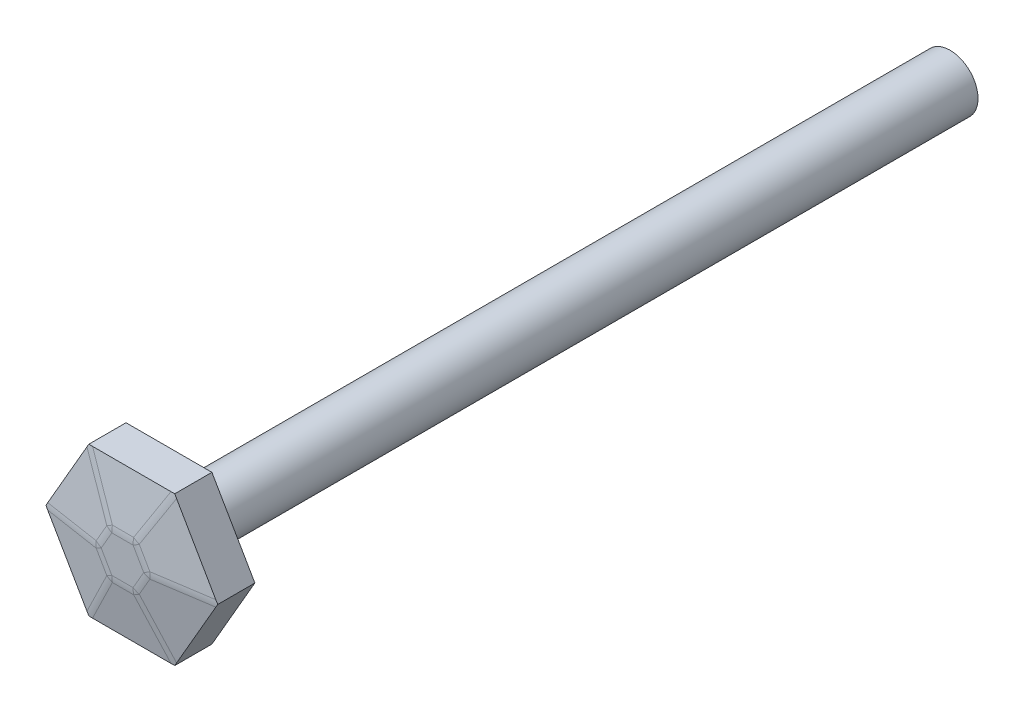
ISO-10303-21;
HEADER;
FILE_DESCRIPTION(('STEP AP214'),'2;1');
FILE_NAME('part.step','',(''),(''),'','','');
FILE_SCHEMA(('AUTOMOTIVE_DESIGN { 1 0 10303 214 1 1 1 1 }'));
ENDSEC;
DATA;
#1=APPLICATION_CONTEXT('core data for automotive mechanical design processes');
#2=APPLICATION_PROTOCOL_DEFINITION('international standard','automotive_design',2000,#1);
#3=PRODUCT_CONTEXT('',#1,'mechanical');
#4=PRODUCT('Part','Part','',(#3));
#5=PRODUCT_RELATED_PRODUCT_CATEGORY('part','',(#4));
#6=PRODUCT_DEFINITION_FORMATION('','',#4);
#7=PRODUCT_DEFINITION_CONTEXT('part definition',#1,'design');
#8=PRODUCT_DEFINITION('design','',#6,#7);
#9=PRODUCT_DEFINITION_SHAPE('','',#8);
#10=(LENGTH_UNIT() NAMED_UNIT(*) SI_UNIT(.MILLI.,.METRE.));
#11=(NAMED_UNIT(*) PLANE_ANGLE_UNIT() SI_UNIT($,.RADIAN.));
#12=(NAMED_UNIT(*) SI_UNIT($,.STERADIAN.) SOLID_ANGLE_UNIT());
#13=UNCERTAINTY_MEASURE_WITH_UNIT(LENGTH_MEASURE(1.E-05),#10,'distance_accuracy_value','');
#14=(GEOMETRIC_REPRESENTATION_CONTEXT(3) GLOBAL_UNCERTAINTY_ASSIGNED_CONTEXT((#13)) GLOBAL_UNIT_ASSIGNED_CONTEXT((#10,
#11,#12)) REPRESENTATION_CONTEXT('',''));
#15=CARTESIAN_POINT('',(0.,0.,0.));
#16=DIRECTION('',(0.,0.,1.));
#17=DIRECTION('',(1.,0.,0.));
#18=AXIS2_PLACEMENT_3D('',#15,#16,#17);
#19=CARTESIAN_POINT('',(0.,0.,53.34));
#20=DIRECTION('',(0.,0.,-1.));
#21=DIRECTION('',(-1.,0.,0.));
#22=AXIS2_PLACEMENT_3D('',#19,#20,#21);
#23=CYLINDRICAL_SURFACE('',#22,1.905);
#24=CARTESIAN_POINT('',(0.,0.,53.34));
#25=DIRECTION('',(0.,0.,1.));
#26=DIRECTION('',(1.,0.,0.));
#27=AXIS2_PLACEMENT_3D('',#24,#25,#26);
#28=CIRCLE('',#27,1.905);
#29=CARTESIAN_POINT('',(1.905,0.,53.34));
#30=VERTEX_POINT('',#29);
#31=EDGE_CURVE('E228',#30,#30,#28,.T.);
#32=ORIENTED_EDGE('',*,*,#31,.F.);
#33=EDGE_LOOP('',(#32));
#34=FACE_BOUND('',#33,.T.);
#35=CARTESIAN_POINT('',(0.,0.,0.));
#36=DIRECTION('',(0.,0.,1.));
#37=DIRECTION('',(1.,0.,0.));
#38=AXIS2_PLACEMENT_3D('',#35,#36,#37);
#39=CIRCLE('',#38,1.905);
#40=CARTESIAN_POINT('',(1.905,0.,0.));
#41=VERTEX_POINT('',#40);
#42=EDGE_CURVE('E190',#41,#41,#39,.T.);
#43=ORIENTED_EDGE('',*,*,#42,.T.);
#44=EDGE_LOOP('',(#43));
#45=FACE_BOUND('',#44,.T.);
#46=ADVANCED_FACE('F32',(#34,#45),#23,.T.);
#47=CARTESIAN_POINT('',(0.,0.,0.));
#48=DIRECTION('',(0.,0.,1.));
#49=DIRECTION('',(1.,0.,0.));
#50=AXIS2_PLACEMENT_3D('',#47,#48,#49);
#51=PLANE('',#50);
#52=ORIENTED_EDGE('',*,*,#42,.F.);
#53=EDGE_LOOP('',(#52));
#54=FACE_BOUND('',#53,.T.);
#55=ADVANCED_FACE('F466',(#54),#51,.F.);
#56=CARTESIAN_POINT('',(5.8658787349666,0.,53.34));
#57=DIRECTION('',(0.,0.,1.));
#58=DIRECTION('',(1.,0.,0.));
#59=AXIS2_PLACEMENT_3D('',#56,#57,#58);
#60=PLANE('',#59);
#61=DIRECTION('',(0.5,0.866025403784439,0.));
#62=VECTOR('',#61,1.);
#63=CARTESIAN_POINT('',(2.9329393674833,-5.08,53.34));
#64=LINE('',#63,#62);
#65=CARTESIAN_POINT('',(2.9329393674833,-5.08,53.34));
#66=VERTEX_POINT('',#65);
#67=CARTESIAN_POINT('',(5.8658787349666,0.,53.34));
#68=VERTEX_POINT('',#67);
#69=EDGE_CURVE('E198',#66,#68,#64,.T.);
#70=ORIENTED_EDGE('',*,*,#69,.F.);
#71=DIRECTION('',(1.,0.,0.));
#72=VECTOR('',#71,1.);
#73=CARTESIAN_POINT('',(-2.9329393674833,-5.08,53.34));
#74=LINE('',#73,#72);
#75=CARTESIAN_POINT('',(-2.9329393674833,-5.08,53.34));
#76=VERTEX_POINT('',#75);
#77=EDGE_CURVE('E218',#76,#66,#74,.T.);
#78=ORIENTED_EDGE('',*,*,#77,.F.);
#79=DIRECTION('',(0.5,-0.866025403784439,0.));
#80=VECTOR('',#79,1.);
#81=CARTESIAN_POINT('',(-5.8658787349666,0.,53.34));
#82=LINE('',#81,#80);
#83=CARTESIAN_POINT('',(-5.8658787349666,0.,53.34));
#84=VERTEX_POINT('',#83);
#85=EDGE_CURVE('E215',#84,#76,#82,.T.);
#86=ORIENTED_EDGE('',*,*,#85,.F.);
#87=DIRECTION('',(-0.5,-0.866025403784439,0.));
#88=VECTOR('',#87,1.);
#89=CARTESIAN_POINT('',(-2.9329393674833,5.08,53.34));
#90=LINE('',#89,#88);
#91=CARTESIAN_POINT('',(-2.9329393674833,5.08,53.34));
#92=VERTEX_POINT('',#91);
#93=EDGE_CURVE('E212',#92,#84,#90,.T.);
#94=ORIENTED_EDGE('',*,*,#93,.F.);
#95=DIRECTION('',(-1.,0.,0.));
#96=VECTOR('',#95,1.);
#97=CARTESIAN_POINT('',(2.9329393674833,5.08,53.34));
#98=LINE('',#97,#96);
#99=CARTESIAN_POINT('',(2.9329393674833,5.08,53.34));
#100=VERTEX_POINT('',#99);
#101=EDGE_CURVE('E201',#100,#92,#98,.T.);
#102=ORIENTED_EDGE('',*,*,#101,.F.);
#103=DIRECTION('',(-0.5,0.866025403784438,0.));
#104=VECTOR('',#103,1.);
#105=CARTESIAN_POINT('',(5.8658787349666,0.,53.34));
#106=LINE('',#105,#104);
#107=EDGE_CURVE('E182',#68,#100,#106,.T.);
#108=ORIENTED_EDGE('',*,*,#107,.F.);
#109=EDGE_LOOP('',(#70,#78,#86,#94,#102,#108));
#110=FACE_BOUND('',#109,.T.);
#111=ORIENTED_EDGE('',*,*,#31,.T.);
#112=EDGE_LOOP('',(#111));
#113=FACE_BOUND('',#112,.T.);
#114=ADVANCED_FACE('F195',(#110,#113),#60,.F.);
#115=CARTESIAN_POINT('',(2.9329393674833,-5.08,56.515));
#116=DIRECTION('',(-0.866025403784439,0.5,0.));
#117=DIRECTION('',(-0.5,-0.866025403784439,0.));
#118=AXIS2_PLACEMENT_3D('',#115,#116,#117);
#119=PLANE('',#118);
#120=DIRECTION('',(0.,0.,-1.));
#121=VECTOR('',#120,1.);
#122=CARTESIAN_POINT('',(5.8658787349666,0.,56.515));
#123=LINE('',#122,#121);
#124=CARTESIAN_POINT('',(5.8658787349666,0.,55.8702601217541));
#125=VERTEX_POINT('',#124);
#126=EDGE_CURVE('E178',#125,#68,#123,.T.);
#127=ORIENTED_EDGE('',*,*,#126,.F.);
#128=CARTESIAN_POINT('',(5.8658787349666,0.,53.3008164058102));
#129=DIRECTION('',(-0.866025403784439,0.5,0.));
#130=DIRECTION('',(-0.478195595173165,-0.828259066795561,0.292088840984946));
#131=AXIS2_PLACEMENT_3D('',#128,#129,#130);
#132=ELLIPSE('',#131,2.96693804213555,2.54);
#133=CARTESIAN_POINT('',(5.73855384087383,-0.220533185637,55.88));
#134=VERTEX_POINT('',#133);
#135=EDGE_CURVE('E307',#125,#134,#132,.F.);
#136=ORIENTED_EDGE('',*,*,#135,.T.);
#137=DIRECTION('',(-0.5,-0.866025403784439,0.));
#138=VECTOR('',#137,1.);
#139=CARTESIAN_POINT('',(2.9329393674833,-5.08,55.88));
#140=LINE('',#139,#138);
#141=CARTESIAN_POINT('',(3.06026426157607,-4.859466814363,55.88));
#142=VERTEX_POINT('',#141);
#143=EDGE_CURVE('E231',#134,#142,#140,.T.);
#144=ORIENTED_EDGE('',*,*,#143,.T.);
#145=CARTESIAN_POINT('',(2.9329393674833,-5.08,53.3008164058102));
#146=DIRECTION('',(-0.866025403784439,0.5,0.));
#147=DIRECTION('',(-0.478195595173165,-0.828259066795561,-0.292088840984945));
#148=AXIS2_PLACEMENT_3D('',#145,#146,#147);
#149=ELLIPSE('',#148,2.96693804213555,2.54);
#150=CARTESIAN_POINT('',(2.9329393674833,-5.08,55.8702601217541));
#151=VERTEX_POINT('',#150);
#152=EDGE_CURVE('E305',#142,#151,#149,.F.);
#153=ORIENTED_EDGE('',*,*,#152,.T.);
#154=DIRECTION('',(0.,0.,-1.));
#155=VECTOR('',#154,1.);
#156=CARTESIAN_POINT('',(2.9329393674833,-5.08,56.515));
#157=LINE('',#156,#155);
#158=EDGE_CURVE('E205',#151,#66,#157,.T.);
#159=ORIENTED_EDGE('',*,*,#158,.T.);
#160=ORIENTED_EDGE('',*,*,#69,.T.);
#161=EDGE_LOOP('',(#127,#136,#144,#153,#159,#160));
#162=FACE_BOUND('',#161,.T.);
#163=ADVANCED_FACE('F203',(#162),#119,.F.);
#164=CARTESIAN_POINT('',(5.8658787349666,0.,56.515));
#165=DIRECTION('',(-0.866025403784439,-0.5,0.));
#166=DIRECTION('',(0.5,-0.866025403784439,0.));
#167=AXIS2_PLACEMENT_3D('',#164,#165,#166);
#168=PLANE('',#167);
#169=DIRECTION('',(0.,0.,-1.));
#170=VECTOR('',#169,1.);
#171=CARTESIAN_POINT('',(2.9329393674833,5.08,56.515));
#172=LINE('',#171,#170);
#173=CARTESIAN_POINT('',(2.9329393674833,5.08,55.8702601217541));
#174=VERTEX_POINT('',#173);
#175=EDGE_CURVE('E191',#174,#100,#172,.T.);
#176=ORIENTED_EDGE('',*,*,#175,.F.);
#177=CARTESIAN_POINT('',(2.9329393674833,5.08,53.3008164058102));
#178=DIRECTION('',(-0.866025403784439,-0.5,0.));
#179=DIRECTION('',(0.478195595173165,-0.828259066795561,0.292088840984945));
#180=AXIS2_PLACEMENT_3D('',#177,#178,#179);
#181=ELLIPSE('',#180,2.96693804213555,2.54);
#182=CARTESIAN_POINT('',(3.06026426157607,4.859466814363,55.88));
#183=VERTEX_POINT('',#182);
#184=EDGE_CURVE('E303',#174,#183,#181,.F.);
#185=ORIENTED_EDGE('',*,*,#184,.T.);
#186=DIRECTION('',(0.5,-0.866025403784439,0.));
#187=VECTOR('',#186,1.);
#188=CARTESIAN_POINT('',(5.8658787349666,0.,55.88));
#189=LINE('',#188,#187);
#190=CARTESIAN_POINT('',(5.73855384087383,0.220533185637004,55.88));
#191=VERTEX_POINT('',#190);
#192=EDGE_CURVE('E246',#183,#191,#189,.T.);
#193=ORIENTED_EDGE('',*,*,#192,.T.);
#194=CARTESIAN_POINT('',(5.8658787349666,0.,53.3008164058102));
#195=DIRECTION('',(-0.866025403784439,-0.5,0.));
#196=DIRECTION('',(-0.478195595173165,0.828259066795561,0.292088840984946));
#197=AXIS2_PLACEMENT_3D('',#194,#195,#196);
#198=ELLIPSE('',#197,2.96693804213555,2.54);
#199=EDGE_CURVE('E186',#191,#125,#198,.F.);
#200=ORIENTED_EDGE('',*,*,#199,.T.);
#201=ORIENTED_EDGE('',*,*,#126,.T.);
#202=ORIENTED_EDGE('',*,*,#107,.T.);
#203=EDGE_LOOP('',(#176,#185,#193,#200,#201,#202));
#204=FACE_BOUND('',#203,.T.);
#205=ADVANCED_FACE('F181',(#204),#168,.F.);
#206=CARTESIAN_POINT('',(2.9329393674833,5.08,56.515));
#207=DIRECTION('',(0.,-1.,0.));
#208=DIRECTION('',(0.,0.,-1.));
#209=AXIS2_PLACEMENT_3D('',#206,#207,#208);
#210=PLANE('',#209);
#211=DIRECTION('',(1.,0.,0.));
#212=VECTOR('',#211,1.);
#213=CARTESIAN_POINT('',(2.9329393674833,5.08,55.88));
#214=LINE('',#213,#212);
#215=CARTESIAN_POINT('',(-2.67828957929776,5.08,55.88));
#216=VERTEX_POINT('',#215);
#217=CARTESIAN_POINT('',(2.67828957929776,5.08,55.88));
#218=VERTEX_POINT('',#217);
#219=EDGE_CURVE('E243',#216,#218,#214,.T.);
#220=ORIENTED_EDGE('',*,*,#219,.T.);
#221=CARTESIAN_POINT('',(2.9329393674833,5.08,53.3008164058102));
#222=DIRECTION('',(0.,-1.,0.));
#223=DIRECTION('',(-0.956391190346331,0.,0.292088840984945));
#224=AXIS2_PLACEMENT_3D('',#221,#222,#223);
#225=ELLIPSE('',#224,2.96693804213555,2.54);
#226=EDGE_CURVE('E300',#218,#174,#225,.F.);
#227=ORIENTED_EDGE('',*,*,#226,.T.);
#228=ORIENTED_EDGE('',*,*,#175,.T.);
#229=ORIENTED_EDGE('',*,*,#101,.T.);
#230=DIRECTION('',(0.,0.,-1.));
#231=VECTOR('',#230,1.);
#232=CARTESIAN_POINT('',(-2.9329393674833,5.08,56.515));
#233=LINE('',#232,#231);
#234=CARTESIAN_POINT('',(-2.9329393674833,5.08,55.8702601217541));
#235=VERTEX_POINT('',#234);
#236=EDGE_CURVE('E225',#235,#92,#233,.T.);
#237=ORIENTED_EDGE('',*,*,#236,.F.);
#238=CARTESIAN_POINT('',(-2.9329393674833,5.08,53.3008164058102));
#239=DIRECTION('',(0.,-1.,0.));
#240=DIRECTION('',(0.956391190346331,0.,0.292088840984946));
#241=AXIS2_PLACEMENT_3D('',#238,#239,#240);
#242=ELLIPSE('',#241,2.96693804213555,2.54);
#243=EDGE_CURVE('E298',#235,#216,#242,.F.);
#244=ORIENTED_EDGE('',*,*,#243,.T.);
#245=EDGE_LOOP('',(#220,#227,#228,#229,#237,#244));
#246=FACE_BOUND('',#245,.T.);
#247=ADVANCED_FACE('F386',(#246),#210,.F.);
#248=CARTESIAN_POINT('',(-2.9329393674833,5.08,56.515));
#249=DIRECTION('',(0.866025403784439,-0.5,0.));
#250=DIRECTION('',(0.5,0.866025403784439,0.));
#251=AXIS2_PLACEMENT_3D('',#248,#249,#250);
#252=PLANE('',#251);
#253=DIRECTION('',(0.,0.,-1.));
#254=VECTOR('',#253,1.);
#255=CARTESIAN_POINT('',(-5.8658787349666,0.,56.515));
#256=LINE('',#255,#254);
#257=CARTESIAN_POINT('',(-5.8658787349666,0.,55.8702601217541));
#258=VERTEX_POINT('',#257);
#259=EDGE_CURVE('E223',#258,#84,#256,.T.);
#260=ORIENTED_EDGE('',*,*,#259,.F.);
#261=CARTESIAN_POINT('',(-5.8658787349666,0.,53.3008164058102));
#262=DIRECTION('',(0.866025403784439,-0.5,0.));
#263=DIRECTION('',(-0.478195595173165,-0.828259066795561,-0.292088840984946));
#264=AXIS2_PLACEMENT_3D('',#261,#262,#263);
#265=ELLIPSE('',#264,2.96693804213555,2.54);
#266=CARTESIAN_POINT('',(-5.73855384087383,0.220533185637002,55.88));
#267=VERTEX_POINT('',#266);
#268=EDGE_CURVE('E11',#258,#267,#265,.F.);
#269=ORIENTED_EDGE('',*,*,#268,.T.);
#270=DIRECTION('',(0.5,0.866025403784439,0.));
#271=VECTOR('',#270,1.);
#272=CARTESIAN_POINT('',(-2.9329393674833,5.08,55.88));
#273=LINE('',#272,#271);
#274=CARTESIAN_POINT('',(-3.06026426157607,4.859466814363,55.88));
#275=VERTEX_POINT('',#274);
#276=EDGE_CURVE('E240',#267,#275,#273,.T.);
#277=ORIENTED_EDGE('',*,*,#276,.T.);
#278=CARTESIAN_POINT('',(-2.9329393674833,5.08,53.3008164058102));
#279=DIRECTION('',(0.866025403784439,-0.5,0.));
#280=DIRECTION('',(-0.478195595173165,-0.828259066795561,0.292088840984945));
#281=AXIS2_PLACEMENT_3D('',#278,#279,#280);
#282=ELLIPSE('',#281,2.96693804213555,2.54);
#283=EDGE_CURVE('E41',#275,#235,#282,.F.);
#284=ORIENTED_EDGE('',*,*,#283,.T.);
#285=ORIENTED_EDGE('',*,*,#236,.T.);
#286=ORIENTED_EDGE('',*,*,#93,.T.);
#287=EDGE_LOOP('',(#260,#269,#277,#284,#285,#286));
#288=FACE_BOUND('',#287,.T.);
#289=ADVANCED_FACE('F440',(#288),#252,.F.);
#290=CARTESIAN_POINT('',(-5.8658787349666,0.,56.515));
#291=DIRECTION('',(0.866025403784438,0.5,0.));
#292=DIRECTION('',(-0.5,0.866025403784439,0.));
#293=AXIS2_PLACEMENT_3D('',#290,#291,#292);
#294=PLANE('',#293);
#295=DIRECTION('',(0.,0.,-1.));
#296=VECTOR('',#295,1.);
#297=CARTESIAN_POINT('',(-2.9329393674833,-5.08,56.515));
#298=LINE('',#297,#296);
#299=CARTESIAN_POINT('',(-2.9329393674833,-5.08,55.8702601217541));
#300=VERTEX_POINT('',#299);
#301=EDGE_CURVE('E221',#300,#76,#298,.T.);
#302=ORIENTED_EDGE('',*,*,#301,.F.);
#303=CARTESIAN_POINT('',(-2.9329393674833,-5.08,53.3008164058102));
#304=DIRECTION('',(0.866025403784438,0.5,0.));
#305=DIRECTION('',(0.478195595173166,-0.828259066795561,-0.292088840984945));
#306=AXIS2_PLACEMENT_3D('',#303,#304,#305);
#307=ELLIPSE('',#306,2.96693804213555,2.54);
#308=CARTESIAN_POINT('',(-3.06026426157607,-4.859466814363,55.88));
#309=VERTEX_POINT('',#308);
#310=EDGE_CURVE('E313',#300,#309,#307,.F.);
#311=ORIENTED_EDGE('',*,*,#310,.T.);
#312=DIRECTION('',(-0.5,0.866025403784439,0.));
#313=VECTOR('',#312,1.);
#314=CARTESIAN_POINT('',(-5.8658787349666,0.,55.88));
#315=LINE('',#314,#313);
#316=CARTESIAN_POINT('',(-5.73855384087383,-0.220533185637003,55.88));
#317=VERTEX_POINT('',#316);
#318=EDGE_CURVE('E238',#309,#317,#315,.T.);
#319=ORIENTED_EDGE('',*,*,#318,.T.);
#320=CARTESIAN_POINT('',(-5.8658787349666,0.,53.3008164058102));
#321=DIRECTION('',(0.866025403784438,0.5,0.));
#322=DIRECTION('',(-0.478195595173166,0.828259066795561,-0.292088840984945));
#323=AXIS2_PLACEMENT_3D('',#320,#321,#322);
#324=ELLIPSE('',#323,2.96693804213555,2.54);
#325=EDGE_CURVE('E49',#317,#258,#324,.F.);
#326=ORIENTED_EDGE('',*,*,#325,.T.);
#327=ORIENTED_EDGE('',*,*,#259,.T.);
#328=ORIENTED_EDGE('',*,*,#85,.T.);
#329=EDGE_LOOP('',(#302,#311,#319,#326,#327,#328));
#330=FACE_BOUND('',#329,.T.);
#331=ADVANCED_FACE('F429',(#330),#294,.F.);
#332=CARTESIAN_POINT('',(-2.9329393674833,-5.08,56.515));
#333=DIRECTION('',(0.,1.,0.));
#334=DIRECTION('',(-1.,0.,0.));
#335=AXIS2_PLACEMENT_3D('',#332,#333,#334);
#336=PLANE('',#335);
#337=ORIENTED_EDGE('',*,*,#158,.F.);
#338=CARTESIAN_POINT('',(2.9329393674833,-5.08,53.3008164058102));
#339=DIRECTION('',(0.,1.,0.));
#340=DIRECTION('',(0.956391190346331,0.,-0.292088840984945));
#341=AXIS2_PLACEMENT_3D('',#338,#339,#340);
#342=ELLIPSE('',#341,2.96693804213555,2.54);
#343=CARTESIAN_POINT('',(2.67828957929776,-5.08,55.88));
#344=VERTEX_POINT('',#343);
#345=EDGE_CURVE('E310',#151,#344,#342,.F.);
#346=ORIENTED_EDGE('',*,*,#345,.T.);
#347=DIRECTION('',(-1.,0.,0.));
#348=VECTOR('',#347,1.);
#349=CARTESIAN_POINT('',(-2.9329393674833,-5.08,55.88));
#350=LINE('',#349,#348);
#351=CARTESIAN_POINT('',(-2.67828957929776,-5.08,55.88));
#352=VERTEX_POINT('',#351);
#353=EDGE_CURVE('E236',#344,#352,#350,.T.);
#354=ORIENTED_EDGE('',*,*,#353,.T.);
#355=CARTESIAN_POINT('',(-2.9329393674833,-5.08,53.3008164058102));
#356=DIRECTION('',(0.,1.,0.));
#357=DIRECTION('',(-0.95639119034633,0.,-0.292088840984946));
#358=AXIS2_PLACEMENT_3D('',#355,#356,#357);
#359=ELLIPSE('',#358,2.96693804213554,2.54);
#360=EDGE_CURVE('E57',#352,#300,#359,.F.);
#361=ORIENTED_EDGE('',*,*,#360,.T.);
#362=ORIENTED_EDGE('',*,*,#301,.T.);
#363=ORIENTED_EDGE('',*,*,#77,.T.);
#364=EDGE_LOOP('',(#337,#346,#354,#361,#362,#363));
#365=FACE_BOUND('',#364,.T.);
#366=ADVANCED_FACE('F495',(#365),#336,.F.);
#367=CARTESIAN_POINT('',(5.8658787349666,0.,56.515));
#368=DIRECTION('',(0.,0.,1.));
#369=DIRECTION('',(1.,0.,0.));
#370=AXIS2_PLACEMENT_3D('',#367,#368,#369);
#371=PLANE('',#370);
#372=DIRECTION('',(-0.5,-0.866025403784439,0.));
#373=VECTOR('',#372,1.);
#374=CARTESIAN_POINT('',(0.378295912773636,3.16825741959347,56.515));
#375=LINE('',#374,#373);
#376=CARTESIAN_POINT('',(-0.725449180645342,1.25651483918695,56.515));
#377=VERTEX_POINT('',#376);
#378=CARTESIAN_POINT('',(-1.45089836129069,0.,56.515));
#379=VERTEX_POINT('',#378);
#380=EDGE_CURVE('E256',#377,#379,#375,.T.);
#381=ORIENTED_EDGE('',*,*,#380,.T.);
#382=DIRECTION('',(0.5,-0.866025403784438,0.));
#383=VECTOR('',#382,1.);
#384=CARTESIAN_POINT('',(0.378295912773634,-3.16825741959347,56.515));
#385=LINE('',#384,#383);
#386=CARTESIAN_POINT('',(-0.725449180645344,-1.25651483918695,56.515));
#387=VERTEX_POINT('',#386);
#388=EDGE_CURVE('E258',#379,#387,#385,.T.);
#389=ORIENTED_EDGE('',*,*,#388,.T.);
#390=DIRECTION('',(1.,0.,0.));
#391=VECTOR('',#390,1.);
#392=CARTESIAN_POINT('',(5.8658787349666,-1.25651483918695,56.515));
#393=LINE('',#392,#391);
#394=CARTESIAN_POINT('',(0.725449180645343,-1.25651483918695,56.515));
#395=VERTEX_POINT('',#394);
#396=EDGE_CURVE('E248',#387,#395,#393,.T.);
#397=ORIENTED_EDGE('',*,*,#396,.T.);
#398=DIRECTION('',(0.5,0.866025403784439,0.));
#399=VECTOR('',#398,1.);
#400=CARTESIAN_POINT('',(2.55464345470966,1.91174258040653,56.515));
#401=LINE('',#400,#399);
#402=CARTESIAN_POINT('',(1.45089836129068,0.,56.515));
#403=VERTEX_POINT('',#402);
#404=EDGE_CURVE('E250',#395,#403,#401,.T.);
#405=ORIENTED_EDGE('',*,*,#404,.T.);
#406=DIRECTION('',(-0.5,0.866025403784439,0.));
#407=VECTOR('',#406,1.);
#408=CARTESIAN_POINT('',(2.55464345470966,-1.91174258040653,56.515));
#409=LINE('',#408,#407);
#410=CARTESIAN_POINT('',(0.725449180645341,1.25651483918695,56.515));
#411=VERTEX_POINT('',#410);
#412=EDGE_CURVE('E252',#403,#411,#409,.T.);
#413=ORIENTED_EDGE('',*,*,#412,.T.);
#414=DIRECTION('',(-1.,0.,0.));
#415=VECTOR('',#414,1.);
#416=CARTESIAN_POINT('',(5.8658787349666,1.25651483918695,56.515));
#417=LINE('',#416,#415);
#418=EDGE_CURVE('E254',#411,#377,#417,.T.);
#419=ORIENTED_EDGE('',*,*,#418,.T.);
#420=EDGE_LOOP('',(#381,#389,#397,#405,#413,#419));
#421=FACE_BOUND('',#420,.T.);
#422=ADVANCED_FACE('F399',(#421),#371,.T.);
#423=CARTESIAN_POINT('',(0.185846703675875,3.2793680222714,56.515));
#424=DIRECTION('',(-0.150383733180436,0.0868240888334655,0.984807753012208));
#425=DIRECTION('',(0.988540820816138,0.,0.150953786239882));
#426=AXIS2_PLACEMENT_3D('',#423,#424,#425);
#427=PLANE('',#426);
#428=ORIENTED_EDGE('',*,*,#276,.F.);
#429=DIRECTION('',(-0.988540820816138,0.,-0.150953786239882));
#430=VECTOR('',#429,1.);
#431=CARTESIAN_POINT('',(0.145604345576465,0.220533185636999,56.7785324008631));
#432=LINE('',#431,#430);
#433=CARTESIAN_POINT('',(-1.83287304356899,0.220533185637,56.476411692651));
#434=VERTEX_POINT('',#433);
#435=EDGE_CURVE('E272',#267,#434,#432,.F.);
#436=ORIENTED_EDGE('',*,*,#435,.T.);
#437=DIRECTION('',(-0.5,-0.866025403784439,0.));
#438=VECTOR('',#437,1.);
#439=CARTESIAN_POINT('',(-0.0036787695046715,3.38879060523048,56.476411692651));
#440=LINE('',#439,#438);
#441=CARTESIAN_POINT('',(-1.10742386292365,1.47704802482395,56.476411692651));
#442=VERTEX_POINT('',#441);
#443=EDGE_CURVE('E270',#434,#442,#440,.F.);
#444=ORIENTED_EDGE('',*,*,#443,.T.);
#445=DIRECTION('',(0.494270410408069,-0.856101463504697,0.150953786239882));
#446=VECTOR('',#445,1.);
#447=CARTESIAN_POINT('',(-1.55123834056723,2.24575724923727,56.3408675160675));
#448=LINE('',#447,#446);
#449=EDGE_CURVE('E268',#442,#275,#448,.F.);
#450=ORIENTED_EDGE('',*,*,#449,.T.);
#451=EDGE_LOOP('',(#428,#436,#444,#450));
#452=FACE_BOUND('',#451,.T.);
#453=ADVANCED_FACE('F442',(#452),#427,.T.);
#454=CARTESIAN_POINT('',(0.185846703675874,-3.27936802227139,56.515));
#455=DIRECTION('',(-0.150383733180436,-0.0868240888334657,0.984807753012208));
#456=DIRECTION('',(0.988540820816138,0.,0.150953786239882));
#457=AXIS2_PLACEMENT_3D('',#454,#455,#456);
#458=PLANE('',#457);
#459=ORIENTED_EDGE('',*,*,#318,.F.);
#460=DIRECTION('',(-0.494270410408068,-0.856101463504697,-0.150953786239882));
#461=VECTOR('',#460,1.);
#462=CARTESIAN_POINT('',(-1.55123834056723,-2.24575724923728,56.3408675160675));
#463=LINE('',#462,#461);
#464=CARTESIAN_POINT('',(-1.10742386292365,-1.47704802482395,56.476411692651));
#465=VERTEX_POINT('',#464);
#466=EDGE_CURVE('E266',#309,#465,#463,.F.);
#467=ORIENTED_EDGE('',*,*,#466,.T.);
#468=DIRECTION('',(0.5,-0.866025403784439,0.));
#469=VECTOR('',#468,1.);
#470=CARTESIAN_POINT('',(-0.00367876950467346,-3.38879060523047,56.476411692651));
#471=LINE('',#470,#469);
#472=CARTESIAN_POINT('',(-1.83287304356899,-0.220533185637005,56.476411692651));
#473=VERTEX_POINT('',#472);
#474=EDGE_CURVE('E263',#465,#473,#471,.F.);
#475=ORIENTED_EDGE('',*,*,#474,.T.);
#476=DIRECTION('',(-0.988540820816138,0.,-0.150953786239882));
#477=VECTOR('',#476,1.);
#478=CARTESIAN_POINT('',(0.145604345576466,-0.220533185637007,56.7785324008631));
#479=LINE('',#478,#477);
#480=EDGE_CURVE('E261',#473,#317,#479,.T.);
#481=ORIENTED_EDGE('',*,*,#480,.T.);
#482=EDGE_LOOP('',(#459,#467,#475,#481));
#483=FACE_BOUND('',#482,.T.);
#484=ADVANCED_FACE('F431',(#483),#458,.T.);
#485=CARTESIAN_POINT('',(5.8658787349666,1.47873604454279,56.515));
#486=DIRECTION('',(0.,0.173648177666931,0.984807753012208));
#487=DIRECTION('',(0.,-0.984807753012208,0.173648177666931));
#488=AXIS2_PLACEMENT_3D('',#485,#486,#487);
#489=PLANE('',#488);
#490=DIRECTION('',(-1.,0.,0.));
#491=VECTOR('',#490,1.);
#492=CARTESIAN_POINT('',(5.8658787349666,1.69758121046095,56.476411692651));
#493=LINE('',#492,#491);
#494=CARTESIAN_POINT('',(-0.725449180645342,1.69758121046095,56.476411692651));
#495=VERTEX_POINT('',#494);
#496=CARTESIAN_POINT('',(0.725449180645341,1.69758121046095,56.476411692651));
#497=VERTEX_POINT('',#496);
#498=EDGE_CURVE('E276',#495,#497,#493,.F.);
#499=ORIENTED_EDGE('',*,*,#498,.T.);
#500=DIRECTION('',(-0.494270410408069,-0.856101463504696,0.150953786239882));
#501=VECTOR('',#500,1.);
#502=CARTESIAN_POINT('',(1.88579024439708,3.70735088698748,56.1220350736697));
#503=LINE('',#502,#501);
#504=EDGE_CURVE('E278',#497,#218,#503,.F.);
#505=ORIENTED_EDGE('',*,*,#504,.T.);
#506=ORIENTED_EDGE('',*,*,#219,.F.);
#507=DIRECTION('',(0.494270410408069,-0.856101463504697,0.150953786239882));
#508=VECTOR('',#507,1.);
#509=CARTESIAN_POINT('',(0.980316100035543,-1.25689092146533,56.9973648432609));
#510=LINE('',#509,#508);
#511=EDGE_CURVE('E274',#216,#495,#510,.T.);
#512=ORIENTED_EDGE('',*,*,#511,.T.);
#513=EDGE_LOOP('',(#499,#505,#506,#512));
#514=FACE_BOUND('',#513,.T.);
#515=ADVANCED_FACE('F382',(#514),#489,.T.);
#516=CARTESIAN_POINT('',(5.8658787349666,-1.47873604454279,56.515));
#517=DIRECTION('',(0.,-0.173648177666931,0.984807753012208));
#518=DIRECTION('',(0.,-0.984807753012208,-0.173648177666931));
#519=AXIS2_PLACEMENT_3D('',#516,#517,#518);
#520=PLANE('',#519);
#521=ORIENTED_EDGE('',*,*,#353,.F.);
#522=DIRECTION('',(0.494270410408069,-0.856101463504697,-0.150953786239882));
#523=VECTOR('',#522,1.);
#524=CARTESIAN_POINT('',(1.88579024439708,-3.70735088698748,56.1220350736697));
#525=LINE('',#524,#523);
#526=CARTESIAN_POINT('',(0.725449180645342,-1.69758121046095,56.476411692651));
#527=VERTEX_POINT('',#526);
#528=EDGE_CURVE('E296',#344,#527,#525,.F.);
#529=ORIENTED_EDGE('',*,*,#528,.T.);
#530=DIRECTION('',(1.,0.,0.));
#531=VECTOR('',#530,1.);
#532=CARTESIAN_POINT('',(5.8658787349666,-1.69758121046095,56.476411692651));
#533=LINE('',#532,#531);
#534=CARTESIAN_POINT('',(-0.725449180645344,-1.69758121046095,56.476411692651));
#535=VERTEX_POINT('',#534);
#536=EDGE_CURVE('E294',#527,#535,#533,.F.);
#537=ORIENTED_EDGE('',*,*,#536,.T.);
#538=DIRECTION('',(-0.494270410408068,-0.856101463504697,-0.150953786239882));
#539=VECTOR('',#538,1.);
#540=CARTESIAN_POINT('',(0.980316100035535,1.25689092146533,56.9973648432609));
#541=LINE('',#540,#539);
#542=EDGE_CURVE('E292',#535,#352,#541,.T.);
#543=ORIENTED_EDGE('',*,*,#542,.T.);
#544=EDGE_LOOP('',(#521,#529,#537,#543));
#545=FACE_BOUND('',#544,.T.);
#546=ADVANCED_FACE('F420',(#545),#520,.T.);
#547=CARTESIAN_POINT('',(2.74709266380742,-1.8006319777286,56.515));
#548=DIRECTION('',(0.150383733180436,0.0868240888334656,0.984807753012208));
#549=DIRECTION('',(0.988540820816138,0.,-0.150953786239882));
#550=AXIS2_PLACEMENT_3D('',#547,#548,#549);
#551=PLANE('',#550);
#552=ORIENTED_EDGE('',*,*,#192,.F.);
#553=DIRECTION('',(-0.494270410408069,-0.856101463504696,0.150953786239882));
#554=VECTOR('',#553,1.);
#555=CARTESIAN_POINT('',(0.118185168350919,-0.23636365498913,56.7785324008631));
#556=LINE('',#555,#554);
#557=CARTESIAN_POINT('',(1.10742386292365,1.47704802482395,56.476411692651));
#558=VERTEX_POINT('',#557);
#559=EDGE_CURVE('E284',#183,#558,#556,.T.);
#560=ORIENTED_EDGE('',*,*,#559,.T.);
#561=DIRECTION('',(-0.5,0.866025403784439,0.));
#562=VECTOR('',#561,1.);
#563=CARTESIAN_POINT('',(2.93661813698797,-1.69120939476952,56.476411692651));
#564=LINE('',#563,#562);
#565=CARTESIAN_POINT('',(1.83287304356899,0.220533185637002,56.476411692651));
#566=VERTEX_POINT('',#565);
#567=EDGE_CURVE('E282',#558,#566,#564,.F.);
#568=ORIENTED_EDGE('',*,*,#567,.T.);
#569=DIRECTION('',(-0.988540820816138,0.,0.150953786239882));
#570=VECTOR('',#569,1.);
#571=CARTESIAN_POINT('',(2.72050199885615,0.220533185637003,56.3408675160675));
#572=LINE('',#571,#570);
#573=EDGE_CURVE('E280',#566,#191,#572,.F.);
#574=ORIENTED_EDGE('',*,*,#573,.T.);
#575=EDGE_LOOP('',(#552,#560,#568,#574));
#576=FACE_BOUND('',#575,.T.);
#577=ADVANCED_FACE('F481',(#576),#551,.T.);
#578=CARTESIAN_POINT('',(2.74709266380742,1.80063197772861,56.515));
#579=DIRECTION('',(0.150383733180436,-0.0868240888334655,0.984807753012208));
#580=DIRECTION('',(0.988540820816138,0.,-0.150953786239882));
#581=AXIS2_PLACEMENT_3D('',#578,#579,#580);
#582=PLANE('',#581);
#583=ORIENTED_EDGE('',*,*,#143,.F.);
#584=DIRECTION('',(-0.988540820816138,0.,0.150953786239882));
#585=VECTOR('',#584,1.);
#586=CARTESIAN_POINT('',(2.72050199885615,-0.220533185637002,56.3408675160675));
#587=LINE('',#586,#585);
#588=CARTESIAN_POINT('',(1.83287304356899,-0.220533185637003,56.476411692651));
#589=VERTEX_POINT('',#588);
#590=EDGE_CURVE('E290',#134,#589,#587,.T.);
#591=ORIENTED_EDGE('',*,*,#590,.T.);
#592=DIRECTION('',(0.5,0.866025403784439,0.));
#593=VECTOR('',#592,1.);
#594=CARTESIAN_POINT('',(2.93661813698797,1.69120939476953,56.476411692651));
#595=LINE('',#594,#593);
#596=CARTESIAN_POINT('',(1.10742386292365,-1.47704802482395,56.476411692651));
#597=VERTEX_POINT('',#596);
#598=EDGE_CURVE('E288',#589,#597,#595,.F.);
#599=ORIENTED_EDGE('',*,*,#598,.T.);
#600=DIRECTION('',(0.494270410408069,-0.856101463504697,-0.150953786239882));
#601=VECTOR('',#600,1.);
#602=CARTESIAN_POINT('',(0.118185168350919,0.236363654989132,56.7785324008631));
#603=LINE('',#602,#601);
#604=EDGE_CURVE('E286',#597,#142,#603,.T.);
#605=ORIENTED_EDGE('',*,*,#604,.T.);
#606=EDGE_LOOP('',(#583,#591,#599,#605));
#607=FACE_BOUND('',#606,.T.);
#608=ADVANCED_FACE('F478',(#607),#582,.T.);
#609=CARTESIAN_POINT('',(-0.263789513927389,-0.456896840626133,54.2771207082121));
#610=DIRECTION('',(-0.494270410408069,-0.856101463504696,0.150953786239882));
#611=DIRECTION('',(0.866025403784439,-0.5,0.));
#612=AXIS2_PLACEMENT_3D('',#609,#610,#611);
#613=CYLINDRICAL_SURFACE('',#612,2.54);
#614=ORIENTED_EDGE('',*,*,#226,.F.);
#615=ORIENTED_EDGE('',*,*,#504,.F.);
#616=CARTESIAN_POINT('',(0.725449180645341,1.25651483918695,53.975));
#617=DIRECTION('',(-0.494270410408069,-0.856101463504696,0.150953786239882));
#618=DIRECTION('',(0.866025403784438,-0.5,0.));
#619=AXIS2_PLACEMENT_3D('',#616,#617,#618);
#620=CIRCLE('',#619,2.54);
#621=EDGE_CURVE('E36',#558,#497,#620,.T.);
#622=ORIENTED_EDGE('',*,*,#621,.F.);
#623=ORIENTED_EDGE('',*,*,#559,.F.);
#624=ORIENTED_EDGE('',*,*,#184,.F.);
#625=EDGE_LOOP('',(#614,#615,#622,#623,#624));
#626=FACE_BOUND('',#625,.T.);
#627=ADVANCED_FACE('F34',(#626),#613,.T.);
#628=CARTESIAN_POINT('',(2.55464345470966,-1.91174258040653,53.975));
#629=DIRECTION('',(-0.5,0.866025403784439,0.));
#630=DIRECTION('',(-0.866025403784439,-0.5,0.));
#631=AXIS2_PLACEMENT_3D('',#628,#629,#630);
#632=CYLINDRICAL_SURFACE('',#631,2.54);
#633=CARTESIAN_POINT('',(1.45089836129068,0.,53.975));
#634=DIRECTION('',(0.500000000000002,-0.866025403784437,0.));
#635=DIRECTION('',(0.866025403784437,0.500000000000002,0.));
#636=AXIS2_PLACEMENT_3D('',#633,#634,#635);
#637=CIRCLE('',#636,2.54);
#638=EDGE_CURVE('E359',#566,#403,#637,.T.);
#639=ORIENTED_EDGE('',*,*,#638,.F.);
#640=ORIENTED_EDGE('',*,*,#567,.F.);
#641=CARTESIAN_POINT('',(0.725449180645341,1.25651483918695,53.975));
#642=DIRECTION('',(-0.5,0.866025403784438,0.));
#643=DIRECTION('',(-0.866025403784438,-0.5,0.));
#644=AXIS2_PLACEMENT_3D('',#641,#642,#643);
#645=CIRCLE('',#644,2.54);
#646=EDGE_CURVE('E209',#411,#558,#645,.T.);
#647=ORIENTED_EDGE('',*,*,#646,.F.);
#648=ORIENTED_EDGE('',*,*,#412,.F.);
#649=EDGE_LOOP('',(#639,#640,#647,#648));
#650=FACE_BOUND('',#649,.T.);
#651=ADVANCED_FACE('F372',(#650),#632,.T.);
#652=CARTESIAN_POINT('',(2.33852731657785,0.,53.8394558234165));
#653=DIRECTION('',(-0.988540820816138,0.,0.150953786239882));
#654=DIRECTION('',(0.150953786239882,0.,0.988540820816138));
#655=AXIS2_PLACEMENT_3D('',#652,#653,#654);
#656=CYLINDRICAL_SURFACE('',#655,2.54);
#657=ORIENTED_EDGE('',*,*,#199,.F.);
#658=ORIENTED_EDGE('',*,*,#573,.F.);
#659=CARTESIAN_POINT('',(1.45089836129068,0.,53.975));
#660=DIRECTION('',(-0.988540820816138,0.,0.150953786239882));
#661=DIRECTION('',(0.150953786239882,0.,0.988540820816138));
#662=AXIS2_PLACEMENT_3D('',#659,#660,#661);
#663=CIRCLE('',#662,2.54);
#664=EDGE_CURVE('E356',#589,#566,#663,.T.);
#665=ORIENTED_EDGE('',*,*,#664,.F.);
#666=ORIENTED_EDGE('',*,*,#590,.F.);
#667=ORIENTED_EDGE('',*,*,#135,.F.);
#668=EDGE_LOOP('',(#657,#658,#665,#666,#667));
#669=FACE_BOUND('',#668,.T.);
#670=ADVANCED_FACE('F590',(#669),#656,.T.);
#671=CARTESIAN_POINT('',(0.725449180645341,1.25651483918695,53.975));
#672=DIRECTION('',(0.,0.,1.));
#673=DIRECTION('',(1.,0.,0.));
#674=AXIS2_PLACEMENT_3D('',#671,#672,#673);
#675=SPHERICAL_SURFACE('',#674,2.54);
#676=ORIENTED_EDGE('',*,*,#646,.T.);
#677=ORIENTED_EDGE('',*,*,#621,.T.);
#678=CARTESIAN_POINT('',(0.725449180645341,1.25651483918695,53.975));
#679=DIRECTION('',(1.,0.,0.));
#680=DIRECTION('',(0.,1.,0.));
#681=AXIS2_PLACEMENT_3D('',#678,#679,#680);
#682=CIRCLE('',#681,2.54);
#683=EDGE_CURVE('E353',#411,#497,#682,.F.);
#684=ORIENTED_EDGE('',*,*,#683,.F.);
#685=EDGE_LOOP('',(#676,#677,#684));
#686=FACE_BOUND('',#685,.T.);
#687=ADVANCED_FACE('F365',(#686),#675,.T.);
#688=CARTESIAN_POINT('',(1.45089836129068,0.,53.975));
#689=DIRECTION('',(0.,0.,1.));
#690=DIRECTION('',(1.,0.,0.));
#691=AXIS2_PLACEMENT_3D('',#688,#689,#690);
#692=SPHERICAL_SURFACE('',#691,2.54);
#693=ORIENTED_EDGE('',*,*,#664,.T.);
#694=ORIENTED_EDGE('',*,*,#638,.T.);
#695=CARTESIAN_POINT('',(1.45089836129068,0.,53.975));
#696=DIRECTION('',(0.499999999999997,0.866025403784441,0.));
#697=DIRECTION('',(-0.866025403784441,0.499999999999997,0.));
#698=AXIS2_PLACEMENT_3D('',#695,#696,#697);
#699=CIRCLE('',#698,2.54);
#700=EDGE_CURVE('E350',#589,#403,#699,.F.);
#701=ORIENTED_EDGE('',*,*,#700,.F.);
#702=EDGE_LOOP('',(#693,#694,#701));
#703=FACE_BOUND('',#702,.T.);
#704=ADVANCED_FACE('F607',(#703),#692,.T.);
#705=CARTESIAN_POINT('',(0.980316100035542,-1.69795729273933,54.4959531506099));
#706=DIRECTION('',(0.494270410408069,-0.856101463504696,0.150953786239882));
#707=DIRECTION('',(0.866025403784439,0.5,0.));
#708=AXIS2_PLACEMENT_3D('',#705,#706,#707);
#709=CYLINDRICAL_SURFACE('',#708,2.54);
#710=ORIENTED_EDGE('',*,*,#283,.F.);
#711=ORIENTED_EDGE('',*,*,#449,.F.);
#712=CARTESIAN_POINT('',(-0.725449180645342,1.25651483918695,53.975));
#713=DIRECTION('',(0.49427041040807,-0.856101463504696,0.150953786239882));
#714=DIRECTION('',(0.866025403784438,0.500000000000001,0.));
#715=AXIS2_PLACEMENT_3D('',#712,#713,#714);
#716=CIRCLE('',#715,2.54);
#717=EDGE_CURVE('E347',#495,#442,#716,.T.);
#718=ORIENTED_EDGE('',*,*,#717,.F.);
#719=ORIENTED_EDGE('',*,*,#511,.F.);
#720=ORIENTED_EDGE('',*,*,#243,.F.);
#721=EDGE_LOOP('',(#710,#711,#718,#719,#720));
#722=FACE_BOUND('',#721,.T.);
#723=ADVANCED_FACE('F391',(#722),#709,.T.);
#724=CARTESIAN_POINT('',(5.8658787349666,1.25651483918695,53.975));
#725=DIRECTION('',(-1.,0.,0.));
#726=DIRECTION('',(0.,0.,1.));
#727=AXIS2_PLACEMENT_3D('',#724,#725,#726);
#728=CYLINDRICAL_SURFACE('',#727,2.54);
#729=ORIENTED_EDGE('',*,*,#683,.T.);
#730=ORIENTED_EDGE('',*,*,#498,.F.);
#731=CARTESIAN_POINT('',(-0.725449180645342,1.25651483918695,53.975));
#732=DIRECTION('',(-1.,0.,0.));
#733=DIRECTION('',(0.,-1.,0.));
#734=AXIS2_PLACEMENT_3D('',#731,#732,#733);
#735=CIRCLE('',#734,2.54);
#736=EDGE_CURVE('E344',#377,#495,#735,.T.);
#737=ORIENTED_EDGE('',*,*,#736,.F.);
#738=ORIENTED_EDGE('',*,*,#418,.F.);
#739=EDGE_LOOP('',(#729,#730,#737,#738));
#740=FACE_BOUND('',#739,.T.);
#741=ADVANCED_FACE('F396',(#740),#728,.T.);
#742=CARTESIAN_POINT('',(2.55464345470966,1.91174258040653,53.975));
#743=DIRECTION('',(0.5,0.866025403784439,0.));
#744=DIRECTION('',(-0.866025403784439,0.5,0.));
#745=AXIS2_PLACEMENT_3D('',#742,#743,#744);
#746=CYLINDRICAL_SURFACE('',#745,2.54);
#747=ORIENTED_EDGE('',*,*,#700,.T.);
#748=ORIENTED_EDGE('',*,*,#404,.F.);
#749=CARTESIAN_POINT('',(0.725449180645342,-1.25651483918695,53.975));
#750=DIRECTION('',(-0.5,-0.866025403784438,0.));
#751=DIRECTION('',(0.866025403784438,-0.500000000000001,0.));
#752=AXIS2_PLACEMENT_3D('',#749,#750,#751);
#753=CIRCLE('',#752,2.54);
#754=EDGE_CURVE('E341',#597,#395,#753,.T.);
#755=ORIENTED_EDGE('',*,*,#754,.F.);
#756=ORIENTED_EDGE('',*,*,#598,.F.);
#757=EDGE_LOOP('',(#747,#748,#755,#756));
#758=FACE_BOUND('',#757,.T.);
#759=ADVANCED_FACE('F406',(#758),#746,.T.);
#760=CARTESIAN_POINT('',(-0.263789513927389,0.456896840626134,54.2771207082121));
#761=DIRECTION('',(0.494270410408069,-0.856101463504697,-0.150953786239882));
#762=DIRECTION('',(0.866025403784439,0.5,0.));
#763=AXIS2_PLACEMENT_3D('',#760,#761,#762);
#764=CYLINDRICAL_SURFACE('',#763,2.54);
#765=ORIENTED_EDGE('',*,*,#152,.F.);
#766=ORIENTED_EDGE('',*,*,#604,.F.);
#767=CARTESIAN_POINT('',(0.725449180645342,-1.25651483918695,53.975));
#768=DIRECTION('',(-0.494270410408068,0.856101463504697,0.150953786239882));
#769=DIRECTION('',(-0.866025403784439,-0.499999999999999,0.));
#770=AXIS2_PLACEMENT_3D('',#767,#768,#769);
#771=CIRCLE('',#770,2.54);
#772=EDGE_CURVE('E338',#527,#597,#771,.T.);
#773=ORIENTED_EDGE('',*,*,#772,.F.);
#774=ORIENTED_EDGE('',*,*,#528,.F.);
#775=ORIENTED_EDGE('',*,*,#345,.F.);
#776=EDGE_LOOP('',(#765,#766,#773,#774,#775));
#777=FACE_BOUND('',#776,.T.);
#778=ADVANCED_FACE('F641',(#777),#764,.T.);
#779=CARTESIAN_POINT('',(-0.725449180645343,1.25651483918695,53.975));
#780=DIRECTION('',(0.,0.,1.));
#781=DIRECTION('',(1.,0.,0.));
#782=AXIS2_PLACEMENT_3D('',#779,#780,#781);
#783=SPHERICAL_SURFACE('',#782,2.54);
#784=ORIENTED_EDGE('',*,*,#736,.T.);
#785=ORIENTED_EDGE('',*,*,#717,.T.);
#786=CARTESIAN_POINT('',(-0.725449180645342,1.25651483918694,53.975));
#787=DIRECTION('',(0.499999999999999,0.866025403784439,0.));
#788=DIRECTION('',(-0.866025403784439,0.499999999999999,0.));
#789=AXIS2_PLACEMENT_3D('',#786,#787,#788);
#790=CIRCLE('',#789,2.54);
#791=EDGE_CURVE('E335',#377,#442,#790,.F.);
#792=ORIENTED_EDGE('',*,*,#791,.F.);
#793=EDGE_LOOP('',(#784,#785,#792));
#794=FACE_BOUND('',#793,.T.);
#795=ADVANCED_FACE('F445',(#794),#783,.T.);
#796=CARTESIAN_POINT('',(0.725449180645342,-1.25651483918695,53.975));
#797=DIRECTION('',(0.,0.,1.));
#798=DIRECTION('',(1.,0.,0.));
#799=AXIS2_PLACEMENT_3D('',#796,#797,#798);
#800=SPHERICAL_SURFACE('',#799,2.54);
#801=ORIENTED_EDGE('',*,*,#772,.T.);
#802=ORIENTED_EDGE('',*,*,#754,.T.);
#803=CARTESIAN_POINT('',(0.725449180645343,-1.25651483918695,53.975));
#804=DIRECTION('',(1.,0.,0.));
#805=DIRECTION('',(0.,1.,0.));
#806=AXIS2_PLACEMENT_3D('',#803,#804,#805);
#807=CIRCLE('',#806,2.54);
#808=EDGE_CURVE('E332',#527,#395,#807,.F.);
#809=ORIENTED_EDGE('',*,*,#808,.F.);
#810=EDGE_LOOP('',(#801,#802,#809));
#811=FACE_BOUND('',#810,.T.);
#812=ADVANCED_FACE('F411',(#811),#800,.T.);
#813=CARTESIAN_POINT('',(0.527579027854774,0.,54.2771207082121));
#814=DIRECTION('',(-0.988540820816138,0.,-0.150953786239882));
#815=DIRECTION('',(-0.150953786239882,0.,0.988540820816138));
#816=AXIS2_PLACEMENT_3D('',#813,#814,#815);
#817=CYLINDRICAL_SURFACE('',#816,2.54);
#818=ORIENTED_EDGE('',*,*,#325,.F.);
#819=ORIENTED_EDGE('',*,*,#480,.F.);
#820=CARTESIAN_POINT('',(-1.45089836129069,0.,53.975));
#821=DIRECTION('',(0.988540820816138,0.,0.150953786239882));
#822=DIRECTION('',(0.150953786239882,0.,-0.988540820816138));
#823=AXIS2_PLACEMENT_3D('',#820,#821,#822);
#824=CIRCLE('',#823,2.54);
#825=EDGE_CURVE('E329',#434,#473,#824,.T.);
#826=ORIENTED_EDGE('',*,*,#825,.F.);
#827=ORIENTED_EDGE('',*,*,#435,.F.);
#828=ORIENTED_EDGE('',*,*,#268,.F.);
#829=EDGE_LOOP('',(#818,#819,#826,#827,#828));
#830=FACE_BOUND('',#829,.T.);
#831=ADVANCED_FACE('F435',(#830),#817,.T.);
#832=CARTESIAN_POINT('',(0.378295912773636,3.16825741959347,53.975));
#833=DIRECTION('',(-0.5,-0.866025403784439,0.));
#834=DIRECTION('',(0.866025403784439,-0.5,0.));
#835=AXIS2_PLACEMENT_3D('',#832,#833,#834);
#836=CYLINDRICAL_SURFACE('',#835,2.54);
#837=ORIENTED_EDGE('',*,*,#791,.T.);
#838=ORIENTED_EDGE('',*,*,#443,.F.);
#839=CARTESIAN_POINT('',(-1.45089836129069,0.,53.975));
#840=DIRECTION('',(-0.5,-0.866025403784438,0.));
#841=DIRECTION('',(0.866025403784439,-0.5,0.));
#842=AXIS2_PLACEMENT_3D('',#839,#840,#841);
#843=CIRCLE('',#842,2.54);
#844=EDGE_CURVE('E326',#379,#434,#843,.T.);
#845=ORIENTED_EDGE('',*,*,#844,.F.);
#846=ORIENTED_EDGE('',*,*,#380,.F.);
#847=EDGE_LOOP('',(#837,#838,#845,#846));
#848=FACE_BOUND('',#847,.T.);
#849=ADVANCED_FACE('F447',(#848),#836,.T.);
#850=CARTESIAN_POINT('',(5.8658787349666,-1.25651483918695,53.975));
#851=DIRECTION('',(1.,0.,0.));
#852=DIRECTION('',(0.,1.,0.));
#853=AXIS2_PLACEMENT_3D('',#850,#851,#852);
#854=CYLINDRICAL_SURFACE('',#853,2.54);
#855=ORIENTED_EDGE('',*,*,#808,.T.);
#856=ORIENTED_EDGE('',*,*,#396,.F.);
#857=CARTESIAN_POINT('',(-0.725449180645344,-1.25651483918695,53.975));
#858=DIRECTION('',(-1.,0.,0.));
#859=DIRECTION('',(0.,-1.,0.));
#860=AXIS2_PLACEMENT_3D('',#857,#858,#859);
#861=CIRCLE('',#860,2.54);
#862=EDGE_CURVE('E323',#535,#387,#861,.T.);
#863=ORIENTED_EDGE('',*,*,#862,.F.);
#864=ORIENTED_EDGE('',*,*,#536,.F.);
#865=EDGE_LOOP('',(#855,#856,#863,#864));
#866=FACE_BOUND('',#865,.T.);
#867=ADVANCED_FACE('F415',(#866),#854,.T.);
#868=CARTESIAN_POINT('',(0.980316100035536,1.69795729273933,54.4959531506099));
#869=DIRECTION('',(-0.494270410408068,-0.856101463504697,-0.150953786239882));
#870=DIRECTION('',(0.866025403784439,-0.499999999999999,0.));
#871=AXIS2_PLACEMENT_3D('',#868,#869,#870);
#872=CYLINDRICAL_SURFACE('',#871,2.54);
#873=ORIENTED_EDGE('',*,*,#360,.F.);
#874=ORIENTED_EDGE('',*,*,#542,.F.);
#875=CARTESIAN_POINT('',(-0.725449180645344,-1.25651483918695,53.975));
#876=DIRECTION('',(0.494270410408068,0.856101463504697,0.150953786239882));
#877=DIRECTION('',(-0.866025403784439,0.499999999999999,0.));
#878=AXIS2_PLACEMENT_3D('',#875,#876,#877);
#879=CIRCLE('',#878,2.54);
#880=EDGE_CURVE('E320',#465,#535,#879,.T.);
#881=ORIENTED_EDGE('',*,*,#880,.F.);
#882=ORIENTED_EDGE('',*,*,#466,.F.);
#883=ORIENTED_EDGE('',*,*,#310,.F.);
#884=EDGE_LOOP('',(#873,#874,#881,#882,#883));
#885=FACE_BOUND('',#884,.T.);
#886=ADVANCED_FACE('F424',(#885),#872,.T.);
#887=CARTESIAN_POINT('',(-1.45089836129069,0.,53.975));
#888=DIRECTION('',(0.,0.,1.));
#889=DIRECTION('',(1.,0.,0.));
#890=AXIS2_PLACEMENT_3D('',#887,#888,#889);
#891=SPHERICAL_SURFACE('',#890,2.54);
#892=ORIENTED_EDGE('',*,*,#844,.T.);
#893=ORIENTED_EDGE('',*,*,#825,.T.);
#894=CARTESIAN_POINT('',(-1.45089836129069,0.,53.975));
#895=DIRECTION('',(-0.499999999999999,0.866025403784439,0.));
#896=DIRECTION('',(-0.866025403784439,-0.499999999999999,0.));
#897=AXIS2_PLACEMENT_3D('',#894,#895,#896);
#898=CIRCLE('',#897,2.54);
#899=EDGE_CURVE('E318',#379,#473,#898,.F.);
#900=ORIENTED_EDGE('',*,*,#899,.F.);
#901=EDGE_LOOP('',(#892,#893,#900));
#902=FACE_BOUND('',#901,.T.);
#903=ADVANCED_FACE('F451',(#902),#891,.T.);
#904=CARTESIAN_POINT('',(-0.725449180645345,-1.25651483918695,53.975));
#905=DIRECTION('',(0.,0.,1.));
#906=DIRECTION('',(1.,0.,0.));
#907=AXIS2_PLACEMENT_3D('',#904,#905,#906);
#908=SPHERICAL_SURFACE('',#907,2.54);
#909=ORIENTED_EDGE('',*,*,#880,.T.);
#910=ORIENTED_EDGE('',*,*,#862,.T.);
#911=CARTESIAN_POINT('',(-0.725449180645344,-1.25651483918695,53.975));
#912=DIRECTION('',(0.5,-0.866025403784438,0.));
#913=DIRECTION('',(0.866025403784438,0.5,0.));
#914=AXIS2_PLACEMENT_3D('',#911,#912,#913);
#915=CIRCLE('',#914,2.54);
#916=EDGE_CURVE('E316',#465,#387,#915,.F.);
#917=ORIENTED_EDGE('',*,*,#916,.F.);
#918=EDGE_LOOP('',(#909,#910,#917));
#919=FACE_BOUND('',#918,.T.);
#920=ADVANCED_FACE('F456',(#919),#908,.T.);
#921=CARTESIAN_POINT('',(0.378295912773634,-3.16825741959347,53.975));
#922=DIRECTION('',(0.5,-0.866025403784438,0.));
#923=DIRECTION('',(0.866025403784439,0.5,0.));
#924=AXIS2_PLACEMENT_3D('',#921,#922,#923);
#925=CYLINDRICAL_SURFACE('',#924,2.54);
#926=ORIENTED_EDGE('',*,*,#899,.T.);
#927=ORIENTED_EDGE('',*,*,#474,.F.);
#928=ORIENTED_EDGE('',*,*,#916,.T.);
#929=ORIENTED_EDGE('',*,*,#388,.F.);
#930=EDGE_LOOP('',(#926,#927,#928,#929));
#931=FACE_BOUND('',#930,.T.);
#932=ADVANCED_FACE('F453',(#931),#925,.T.);
#933=CLOSED_SHELL('',(#46,#55,#114,#163,#205,#247,#289,#331,#366,#422,#453,#484,#515,#546,#577,
#608,#627,#651,#670,#687,#704,#723,#741,#759,#778,#795,#812,#831,#849,#867,#886,#903,#920,#932));
#934=MANIFOLD_SOLID_BREP('B2',#933);
#935=ADVANCED_BREP_SHAPE_REPRESENTATION('',(#18,#934),#14);
#936=SHAPE_DEFINITION_REPRESENTATION(#9,#935);
ENDSEC;
END-ISO-10303-21;
